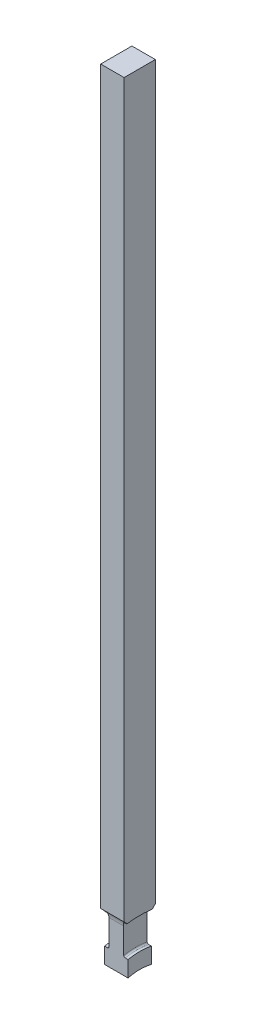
ISO-10303-21;
HEADER;
FILE_DESCRIPTION(('STEP AP214'),'2;1');
FILE_NAME('part.step','',(''),(''),'','','');
FILE_SCHEMA(('AUTOMOTIVE_DESIGN { 1 0 10303 214 1 1 1 1 }'));
ENDSEC;
DATA;
#1=APPLICATION_CONTEXT('core data for automotive mechanical design processes');
#2=APPLICATION_PROTOCOL_DEFINITION('international standard','automotive_design',2000,#1);
#3=PRODUCT_CONTEXT('',#1,'mechanical');
#4=PRODUCT('Part','Part','',(#3));
#5=PRODUCT_RELATED_PRODUCT_CATEGORY('part','',(#4));
#6=PRODUCT_DEFINITION_FORMATION('','',#4);
#7=PRODUCT_DEFINITION_CONTEXT('part definition',#1,'design');
#8=PRODUCT_DEFINITION('design','',#6,#7);
#9=PRODUCT_DEFINITION_SHAPE('','',#8);
#10=(LENGTH_UNIT() NAMED_UNIT(*) SI_UNIT(.MILLI.,.METRE.));
#11=(NAMED_UNIT(*) PLANE_ANGLE_UNIT() SI_UNIT($,.RADIAN.));
#12=(NAMED_UNIT(*) SI_UNIT($,.STERADIAN.) SOLID_ANGLE_UNIT());
#13=UNCERTAINTY_MEASURE_WITH_UNIT(LENGTH_MEASURE(1.E-05),#10,'distance_accuracy_value','');
#14=(GEOMETRIC_REPRESENTATION_CONTEXT(3) GLOBAL_UNCERTAINTY_ASSIGNED_CONTEXT((#13)) GLOBAL_UNIT_ASSIGNED_CONTEXT((#10,
#11,#12)) REPRESENTATION_CONTEXT('',''));
#15=CARTESIAN_POINT('',(0.,0.,0.));
#16=DIRECTION('',(0.,0.,1.));
#17=DIRECTION('',(1.,0.,0.));
#18=AXIS2_PLACEMENT_3D('',#15,#16,#17);
#19=CARTESIAN_POINT('',(3.,212.,4.));
#20=DIRECTION('',(0.,0.,-1.));
#21=DIRECTION('',(0.,1.,0.));
#22=AXIS2_PLACEMENT_3D('',#19,#20,#21);
#23=PLANE('',#22);
#24=DIRECTION('',(0.,-1.,0.));
#25=VECTOR('',#24,1.);
#26=CARTESIAN_POINT('',(-3.,212.,4.));
#27=LINE('',#26,#25);
#28=CARTESIAN_POINT('',(-3.,212.,4.));
#29=VERTEX_POINT('',#28);
#30=CARTESIAN_POINT('',(-3.00000000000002,24.5553873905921,3.99999999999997));
#31=VERTEX_POINT('',#30);
#32=EDGE_CURVE('E236',#29,#31,#27,.T.);
#33=ORIENTED_EDGE('',*,*,#32,.T.);
#34=DIRECTION('',(1.,0.,0.));
#35=VECTOR('',#34,1.);
#36=CARTESIAN_POINT('',(-3.00000000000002,24.5553873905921,3.99999999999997));
#37=LINE('',#36,#35);
#38=CARTESIAN_POINT('',(3.00000000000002,24.5553873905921,3.99999999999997));
#39=VERTEX_POINT('',#38);
#40=EDGE_CURVE('E352',#31,#39,#37,.T.);
#41=ORIENTED_EDGE('',*,*,#40,.T.);
#42=DIRECTION('',(0.,-1.,0.));
#43=VECTOR('',#42,1.);
#44=CARTESIAN_POINT('',(3.,212.,4.));
#45=LINE('',#44,#43);
#46=CARTESIAN_POINT('',(3.,212.,4.));
#47=VERTEX_POINT('',#46);
#48=EDGE_CURVE('E200',#47,#39,#45,.T.);
#49=ORIENTED_EDGE('',*,*,#48,.F.);
#50=DIRECTION('',(-1.,0.,0.));
#51=VECTOR('',#50,1.);
#52=CARTESIAN_POINT('',(3.,212.,4.));
#53=LINE('',#52,#51);
#54=EDGE_CURVE('E191',#47,#29,#53,.T.);
#55=ORIENTED_EDGE('',*,*,#54,.T.);
#56=EDGE_LOOP('',(#33,#41,#49,#55));
#57=FACE_BOUND('',#56,.T.);
#58=ADVANCED_FACE('F37',(#57),#23,.F.);
#59=CARTESIAN_POINT('',(3.,212.,-4.));
#60=DIRECTION('',(0.,0.,1.));
#61=DIRECTION('',(0.,-1.,0.));
#62=AXIS2_PLACEMENT_3D('',#59,#60,#61);
#63=PLANE('',#62);
#64=DIRECTION('',(0.,1.,0.));
#65=VECTOR('',#64,1.);
#66=CARTESIAN_POINT('',(3.,212.,-4.));
#67=LINE('',#66,#65);
#68=CARTESIAN_POINT('',(3.00000000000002,24.5553873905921,-4.00000000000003));
#69=VERTEX_POINT('',#68);
#70=CARTESIAN_POINT('',(3.,212.,-4.));
#71=VERTEX_POINT('',#70);
#72=EDGE_CURVE('E231',#69,#71,#67,.T.);
#73=ORIENTED_EDGE('',*,*,#72,.F.);
#74=DIRECTION('',(1.,0.,0.));
#75=VECTOR('',#74,1.);
#76=CARTESIAN_POINT('',(-3.00000000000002,24.5553873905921,-4.00000000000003));
#77=LINE('',#76,#75);
#78=CARTESIAN_POINT('',(-3.00000000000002,24.5553873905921,-4.00000000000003));
#79=VERTEX_POINT('',#78);
#80=EDGE_CURVE('E387',#69,#79,#77,.F.);
#81=ORIENTED_EDGE('',*,*,#80,.T.);
#82=DIRECTION('',(0.,1.,0.));
#83=VECTOR('',#82,1.);
#84=CARTESIAN_POINT('',(-3.,212.,-4.));
#85=LINE('',#84,#83);
#86=CARTESIAN_POINT('',(-3.,212.,-4.));
#87=VERTEX_POINT('',#86);
#88=EDGE_CURVE('E229',#79,#87,#85,.T.);
#89=ORIENTED_EDGE('',*,*,#88,.T.);
#90=DIRECTION('',(-1.,0.,0.));
#91=VECTOR('',#90,1.);
#92=CARTESIAN_POINT('',(3.,212.,-4.));
#93=LINE('',#92,#91);
#94=EDGE_CURVE('E233',#71,#87,#93,.T.);
#95=ORIENTED_EDGE('',*,*,#94,.F.);
#96=EDGE_LOOP('',(#73,#81,#89,#95));
#97=FACE_BOUND('',#96,.T.);
#98=ADVANCED_FACE('F345',(#97),#63,.F.);
#99=CARTESIAN_POINT('',(3.,0.,0.));
#100=DIRECTION('',(-1.,0.,0.));
#101=DIRECTION('',(0.,0.,1.));
#102=AXIS2_PLACEMENT_3D('',#99,#100,#101);
#103=PLANE('',#102);
#104=CARTESIAN_POINT('',(3.,0.,0.));
#105=DIRECTION('',(1.,0.,0.));
#106=DIRECTION('',(0.,0.,-1.));
#107=AXIS2_PLACEMENT_3D('',#104,#105,#106);
#108=CIRCLE('',#107,12.);
#109=CARTESIAN_POINT('',(3.00000000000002,11.6189500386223,-3.));
#110=VERTEX_POINT('',#109);
#111=CARTESIAN_POINT('',(3.00000000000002,11.6189500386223,3.));
#112=VERTEX_POINT('',#111);
#113=EDGE_CURVE('E210',#110,#112,#108,.T.);
#114=ORIENTED_EDGE('',*,*,#113,.F.);
#115=DIRECTION('',(0.,-1.,0.));
#116=VECTOR('',#115,1.);
#117=CARTESIAN_POINT('',(3.00000000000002,0.,-3.));
#118=LINE('',#117,#116);
#119=CARTESIAN_POINT('',(3.00000000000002,15.7162336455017,-3.));
#120=VERTEX_POINT('',#119);
#121=EDGE_CURVE('E371',#120,#110,#118,.T.);
#122=ORIENTED_EDGE('',*,*,#121,.F.);
#123=CARTESIAN_POINT('',(3.00000000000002,0.,0.));
#124=DIRECTION('',(-1.,0.,0.));
#125=DIRECTION('',(0.,0.,1.));
#126=AXIS2_PLACEMENT_3D('',#123,#124,#125);
#127=CIRCLE('',#126,16.);
#128=CARTESIAN_POINT('',(3.00000000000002,15.7162336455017,3.));
#129=VERTEX_POINT('',#128);
#130=EDGE_CURVE('E206',#129,#120,#127,.T.);
#131=ORIENTED_EDGE('',*,*,#130,.F.);
#132=DIRECTION('',(0.,1.,0.));
#133=VECTOR('',#132,1.);
#134=CARTESIAN_POINT('',(3.00000000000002,0.,3.));
#135=LINE('',#134,#133);
#136=EDGE_CURVE('E201',#112,#129,#135,.T.);
#137=ORIENTED_EDGE('',*,*,#136,.F.);
#138=EDGE_LOOP('',(#114,#122,#131,#137));
#139=FACE_BOUND('',#138,.T.);
#140=ADVANCED_FACE('F339',(#139),#103,.F.);
#141=CARTESIAN_POINT('',(-3.,0.,0.));
#142=DIRECTION('',(-1.,0.,0.));
#143=DIRECTION('',(0.,0.,1.));
#144=AXIS2_PLACEMENT_3D('',#141,#142,#143);
#145=PLANE('',#144);
#146=CARTESIAN_POINT('',(-3.00000000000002,22.6124,-5.3876));
#147=DIRECTION('',(1.,0.,0.));
#148=DIRECTION('',(0.,0.,1.));
#149=AXIS2_PLACEMENT_3D('',#146,#147,#148);
#150=CIRCLE('',#149,2.3876);
#151=CARTESIAN_POINT('',(-3.00000000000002,23.7719741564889,-3.3004915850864));
#152=VERTEX_POINT('',#151);
#153=EDGE_CURVE('E461',#79,#152,#150,.T.);
#154=ORIENTED_EDGE('',*,*,#153,.T.);
#155=CARTESIAN_POINT('',(-3.00000000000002,0.,0.));
#156=DIRECTION('',(-1.,0.,0.));
#157=DIRECTION('',(0.,0.,1.));
#158=AXIS2_PLACEMENT_3D('',#155,#156,#157);
#159=CIRCLE('',#158,24.);
#160=CARTESIAN_POINT('',(-3.00000000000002,23.7719741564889,3.3004915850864));
#161=VERTEX_POINT('',#160);
#162=EDGE_CURVE('E207',#161,#152,#159,.T.);
#163=ORIENTED_EDGE('',*,*,#162,.F.);
#164=CARTESIAN_POINT('',(-3.00000000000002,22.6124,5.3876));
#165=DIRECTION('',(1.,0.,0.));
#166=DIRECTION('',(0.,0.,-1.));
#167=AXIS2_PLACEMENT_3D('',#164,#165,#166);
#168=CIRCLE('',#167,2.3876);
#169=EDGE_CURVE('E359',#161,#31,#168,.T.);
#170=ORIENTED_EDGE('',*,*,#169,.T.);
#171=ORIENTED_EDGE('',*,*,#32,.F.);
#172=DIRECTION('',(0.,0.,1.));
#173=VECTOR('',#172,1.);
#174=CARTESIAN_POINT('',(-3.,212.,4.));
#175=LINE('',#174,#173);
#176=EDGE_CURVE('E226',#87,#29,#175,.T.);
#177=ORIENTED_EDGE('',*,*,#176,.F.);
#178=ORIENTED_EDGE('',*,*,#88,.F.);
#179=EDGE_LOOP('',(#154,#163,#170,#171,#177,#178));
#180=FACE_BOUND('',#179,.T.);
#181=ADVANCED_FACE('F340',(#180),#145,.T.);
#182=DIRECTION('',(0.,-1.,0.));
#183=VECTOR('',#182,1.);
#184=CARTESIAN_POINT('',(-3.00000000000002,0.,-3.));
#185=LINE('',#184,#183);
#186=CARTESIAN_POINT('',(-3.00000000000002,15.7162336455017,-3.));
#187=VERTEX_POINT('',#186);
#188=CARTESIAN_POINT('',(-3.00000000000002,11.6189500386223,-3.));
#189=VERTEX_POINT('',#188);
#190=EDGE_CURVE('E463',#187,#189,#185,.T.);
#191=ORIENTED_EDGE('',*,*,#190,.T.);
#192=CARTESIAN_POINT('',(-3.,0.,0.));
#193=DIRECTION('',(1.,0.,0.));
#194=DIRECTION('',(0.,0.,-1.));
#195=AXIS2_PLACEMENT_3D('',#192,#193,#194);
#196=CIRCLE('',#195,12.);
#197=CARTESIAN_POINT('',(-3.00000000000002,11.6189500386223,3.));
#198=VERTEX_POINT('',#197);
#199=EDGE_CURVE('E223',#189,#198,#196,.T.);
#200=ORIENTED_EDGE('',*,*,#199,.T.);
#201=DIRECTION('',(0.,1.,0.));
#202=VECTOR('',#201,1.);
#203=CARTESIAN_POINT('',(-3.00000000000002,0.,3.));
#204=LINE('',#203,#202);
#205=CARTESIAN_POINT('',(-3.00000000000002,15.7162336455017,3.));
#206=VERTEX_POINT('',#205);
#207=EDGE_CURVE('E362',#198,#206,#204,.T.);
#208=ORIENTED_EDGE('',*,*,#207,.T.);
#209=CARTESIAN_POINT('',(-3.00000000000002,0.,0.));
#210=DIRECTION('',(-1.,0.,0.));
#211=DIRECTION('',(0.,0.,1.));
#212=AXIS2_PLACEMENT_3D('',#209,#210,#211);
#213=CIRCLE('',#212,16.);
#214=EDGE_CURVE('E213',#206,#187,#213,.T.);
#215=ORIENTED_EDGE('',*,*,#214,.T.);
#216=EDGE_LOOP('',(#191,#200,#208,#215));
#217=FACE_BOUND('',#216,.T.);
#218=ADVANCED_FACE('F343',(#217),#145,.T.);
#219=CARTESIAN_POINT('',(3.,212.,4.));
#220=DIRECTION('',(0.,-1.,0.));
#221=DIRECTION('',(0.,0.,-1.));
#222=AXIS2_PLACEMENT_3D('',#219,#220,#221);
#223=PLANE('',#222);
#224=ORIENTED_EDGE('',*,*,#176,.T.);
#225=ORIENTED_EDGE('',*,*,#54,.F.);
#226=DIRECTION('',(0.,0.,1.));
#227=VECTOR('',#226,1.);
#228=CARTESIAN_POINT('',(3.,212.,4.));
#229=LINE('',#228,#227);
#230=EDGE_CURVE('E227',#71,#47,#229,.T.);
#231=ORIENTED_EDGE('',*,*,#230,.F.);
#232=ORIENTED_EDGE('',*,*,#94,.T.);
#233=EDGE_LOOP('',(#224,#225,#231,#232));
#234=FACE_BOUND('',#233,.T.);
#235=ADVANCED_FACE('F283',(#234),#223,.F.);
#236=CARTESIAN_POINT('',(3.00000000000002,0.,0.));
#237=DIRECTION('',(-1.,0.,0.));
#238=DIRECTION('',(0.,0.,1.));
#239=AXIS2_PLACEMENT_3D('',#236,#237,#238);
#240=CIRCLE('',#239,24.);
#241=CARTESIAN_POINT('',(3.00000000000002,23.7719741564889,3.3004915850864));
#242=VERTEX_POINT('',#241);
#243=CARTESIAN_POINT('',(3.00000000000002,23.7719741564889,-3.3004915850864));
#244=VERTEX_POINT('',#243);
#245=EDGE_CURVE('E198',#242,#244,#240,.T.);
#246=ORIENTED_EDGE('',*,*,#245,.T.);
#247=CARTESIAN_POINT('',(3.00000000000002,22.6124,-5.3876));
#248=DIRECTION('',(1.,0.,0.));
#249=DIRECTION('',(0.,0.,1.));
#250=AXIS2_PLACEMENT_3D('',#247,#248,#249);
#251=CIRCLE('',#250,2.3876);
#252=EDGE_CURVE('E467',#69,#244,#251,.T.);
#253=ORIENTED_EDGE('',*,*,#252,.F.);
#254=ORIENTED_EDGE('',*,*,#72,.T.);
#255=ORIENTED_EDGE('',*,*,#230,.T.);
#256=ORIENTED_EDGE('',*,*,#48,.T.);
#257=CARTESIAN_POINT('',(3.00000000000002,22.6124,5.3876));
#258=DIRECTION('',(1.,0.,0.));
#259=DIRECTION('',(0.,0.,-1.));
#260=AXIS2_PLACEMENT_3D('',#257,#258,#259);
#261=CIRCLE('',#260,2.3876);
#262=EDGE_CURVE('E181',#242,#39,#261,.T.);
#263=ORIENTED_EDGE('',*,*,#262,.F.);
#264=EDGE_LOOP('',(#246,#253,#254,#255,#256,#263));
#265=FACE_BOUND('',#264,.T.);
#266=ADVANCED_FACE('F196',(#265),#103,.F.);
#267=CARTESIAN_POINT('',(-3.,0.,0.));
#268=DIRECTION('',(1.,0.,0.));
#269=DIRECTION('',(0.,0.,-1.));
#270=AXIS2_PLACEMENT_3D('',#267,#268,#269);
#271=CYLINDRICAL_SURFACE('',#270,12.);
#272=ORIENTED_EDGE('',*,*,#199,.F.);
#273=DIRECTION('',(1.,0.,0.));
#274=VECTOR('',#273,1.);
#275=CARTESIAN_POINT('',(-3.,11.6189500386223,-3.));
#276=LINE('',#275,#274);
#277=EDGE_CURVE('E216',#189,#110,#276,.T.);
#278=ORIENTED_EDGE('',*,*,#277,.T.);
#279=ORIENTED_EDGE('',*,*,#113,.T.);
#280=DIRECTION('',(1.,0.,0.));
#281=VECTOR('',#280,1.);
#282=CARTESIAN_POINT('',(-3.,11.6189500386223,3.));
#283=LINE('',#282,#281);
#284=EDGE_CURVE('E397',#112,#198,#283,.F.);
#285=ORIENTED_EDGE('',*,*,#284,.T.);
#286=EDGE_LOOP('',(#272,#278,#279,#285));
#287=FACE_BOUND('',#286,.T.);
#288=ADVANCED_FACE('F326',(#287),#271,.F.);
#289=CARTESIAN_POINT('',(-1.905,16.,0.));
#290=DIRECTION('',(-1.,0.,0.));
#291=DIRECTION('',(0.,0.,1.));
#292=AXIS2_PLACEMENT_3D('',#289,#290,#291);
#293=PLANE('',#292);
#294=DIRECTION('',(0.,1.,0.));
#295=VECTOR('',#294,1.);
#296=CARTESIAN_POINT('',(-1.905,16.,-3.));
#297=LINE('',#296,#295);
#298=CARTESIAN_POINT('',(-1.905,16.1039486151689,-3.));
#299=VERTEX_POINT('',#298);
#300=CARTESIAN_POINT('',(-1.905,22.6124,-3.));
#301=VERTEX_POINT('',#300);
#302=EDGE_CURVE('E404',#299,#301,#297,.T.);
#303=ORIENTED_EDGE('',*,*,#302,.F.);
#304=CARTESIAN_POINT('',(-1.905,0.,0.));
#305=DIRECTION('',(-1.,0.,0.));
#306=DIRECTION('',(0.,0.,1.));
#307=AXIS2_PLACEMENT_3D('',#304,#305,#306);
#308=CIRCLE('',#307,16.381);
#309=CARTESIAN_POINT('',(-1.905,16.1039486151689,3.));
#310=VERTEX_POINT('',#309);
#311=EDGE_CURVE('E426',#299,#310,#308,.F.);
#312=ORIENTED_EDGE('',*,*,#311,.T.);
#313=DIRECTION('',(0.,-1.,0.));
#314=VECTOR('',#313,1.);
#315=CARTESIAN_POINT('',(-1.905,16.,3.));
#316=LINE('',#315,#314);
#317=CARTESIAN_POINT('',(-1.905,22.6124,3.));
#318=VERTEX_POINT('',#317);
#319=EDGE_CURVE('E394',#318,#310,#316,.T.);
#320=ORIENTED_EDGE('',*,*,#319,.F.);
#321=CARTESIAN_POINT('',(-1.905,22.6124,5.3876));
#322=DIRECTION('',(-1.,0.,0.));
#323=DIRECTION('',(0.,0.,1.));
#324=AXIS2_PLACEMENT_3D('',#321,#322,#323);
#325=CIRCLE('',#324,2.3876);
#326=CARTESIAN_POINT('',(-1.905,23.0385151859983,3.03833211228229));
#327=VERTEX_POINT('',#326);
#328=EDGE_CURVE('E377',#327,#318,#325,.T.);
#329=ORIENTED_EDGE('',*,*,#328,.F.);
#330=CARTESIAN_POINT('',(-1.905,0.,0.));
#331=DIRECTION('',(-1.,0.,0.));
#332=DIRECTION('',(0.,0.,1.));
#333=AXIS2_PLACEMENT_3D('',#330,#331,#332);
#334=CIRCLE('',#333,23.238);
#335=CARTESIAN_POINT('',(-1.905,23.0385151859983,-3.03833211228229));
#336=VERTEX_POINT('',#335);
#337=EDGE_CURVE('E249',#327,#336,#334,.T.);
#338=ORIENTED_EDGE('',*,*,#337,.T.);
#339=CARTESIAN_POINT('',(-1.905,22.6124,-5.3876));
#340=DIRECTION('',(-1.,0.,0.));
#341=DIRECTION('',(0.,0.,1.));
#342=AXIS2_PLACEMENT_3D('',#339,#340,#341);
#343=CIRCLE('',#342,2.3876);
#344=EDGE_CURVE('E384',#301,#336,#343,.T.);
#345=ORIENTED_EDGE('',*,*,#344,.F.);
#346=EDGE_LOOP('',(#303,#312,#320,#329,#338,#345));
#347=FACE_BOUND('',#346,.T.);
#348=ADVANCED_FACE('F322',(#347),#293,.T.);
#349=CARTESIAN_POINT('',(-8.84822894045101,0.,0.));
#350=DIRECTION('',(-1.,0.,0.));
#351=DIRECTION('',(0.,0.,1.));
#352=AXIS2_PLACEMENT_3D('',#349,#350,#351);
#353=CYLINDRICAL_SURFACE('',#352,24.);
#354=DIRECTION('',(1.,0.,0.));
#355=VECTOR('',#354,1.);
#356=CARTESIAN_POINT('',(-2.45250000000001,23.7719741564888,-3.3004915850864));
#357=LINE('',#356,#355);
#358=CARTESIAN_POINT('',(-2.667,23.7719741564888,-3.3004915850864));
#359=VERTEX_POINT('',#358);
#360=EDGE_CURVE('E382',#359,#152,#357,.F.);
#361=ORIENTED_EDGE('',*,*,#360,.F.);
#362=CARTESIAN_POINT('',(-2.667,0.,0.));
#363=DIRECTION('',(-1.,0.,0.));
#364=DIRECTION('',(0.,0.,1.));
#365=AXIS2_PLACEMENT_3D('',#362,#363,#364);
#366=CIRCLE('',#365,24.);
#367=CARTESIAN_POINT('',(-2.667,23.7719741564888,3.3004915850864));
#368=VERTEX_POINT('',#367);
#369=EDGE_CURVE('E252',#359,#368,#366,.F.);
#370=ORIENTED_EDGE('',*,*,#369,.T.);
#371=DIRECTION('',(1.,0.,0.));
#372=VECTOR('',#371,1.);
#373=CARTESIAN_POINT('',(-2.45250000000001,23.7719741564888,3.3004915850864));
#374=LINE('',#373,#372);
#375=EDGE_CURVE('E374',#161,#368,#374,.T.);
#376=ORIENTED_EDGE('',*,*,#375,.F.);
#377=ORIENTED_EDGE('',*,*,#162,.T.);
#378=EDGE_LOOP('',(#361,#370,#376,#377));
#379=FACE_BOUND('',#378,.T.);
#380=ADVANCED_FACE('F325',(#379),#353,.F.);
#381=CARTESIAN_POINT('',(-8.84822894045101,0.,0.));
#382=DIRECTION('',(-1.,0.,0.));
#383=DIRECTION('',(0.,0.,1.));
#384=AXIS2_PLACEMENT_3D('',#381,#382,#383);
#385=CYLINDRICAL_SURFACE('',#384,16.);
#386=DIRECTION('',(-1.,0.,0.));
#387=VECTOR('',#386,1.);
#388=CARTESIAN_POINT('',(-8.84822894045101,15.7162336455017,3.));
#389=LINE('',#388,#387);
#390=CARTESIAN_POINT('',(-2.286,15.7162336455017,3.));
#391=VERTEX_POINT('',#390);
#392=EDGE_CURVE('E392',#391,#206,#389,.T.);
#393=ORIENTED_EDGE('',*,*,#392,.F.);
#394=CARTESIAN_POINT('',(-2.286,0.,0.));
#395=DIRECTION('',(-1.,0.,0.));
#396=DIRECTION('',(0.,0.,1.));
#397=AXIS2_PLACEMENT_3D('',#394,#395,#396);
#398=CIRCLE('',#397,16.);
#399=CARTESIAN_POINT('',(-2.286,15.7162336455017,-3.));
#400=VERTEX_POINT('',#399);
#401=EDGE_CURVE('E303',#391,#400,#398,.T.);
#402=ORIENTED_EDGE('',*,*,#401,.T.);
#403=DIRECTION('',(-1.,0.,0.));
#404=VECTOR('',#403,1.);
#405=CARTESIAN_POINT('',(-8.84822894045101,15.7162336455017,-3.));
#406=LINE('',#405,#404);
#407=EDGE_CURVE('E402',#187,#400,#406,.F.);
#408=ORIENTED_EDGE('',*,*,#407,.F.);
#409=ORIENTED_EDGE('',*,*,#214,.F.);
#410=EDGE_LOOP('',(#393,#402,#408,#409));
#411=FACE_BOUND('',#410,.T.);
#412=ADVANCED_FACE('F318',(#411),#385,.T.);
#413=CARTESIAN_POINT('',(1.905,16.,0.));
#414=DIRECTION('',(1.,0.,0.));
#415=DIRECTION('',(0.,0.,-1.));
#416=AXIS2_PLACEMENT_3D('',#413,#414,#415);
#417=PLANE('',#416);
#418=DIRECTION('',(0.,1.,0.));
#419=VECTOR('',#418,1.);
#420=CARTESIAN_POINT('',(1.905,16.,3.));
#421=LINE('',#420,#419);
#422=CARTESIAN_POINT('',(1.905,16.1039486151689,3.));
#423=VERTEX_POINT('',#422);
#424=CARTESIAN_POINT('',(1.905,22.6124,3.));
#425=VERTEX_POINT('',#424);
#426=EDGE_CURVE('E390',#423,#425,#421,.T.);
#427=ORIENTED_EDGE('',*,*,#426,.F.);
#428=CARTESIAN_POINT('',(1.905,0.,0.));
#429=DIRECTION('',(1.,0.,0.));
#430=DIRECTION('',(0.,0.,-1.));
#431=AXIS2_PLACEMENT_3D('',#428,#429,#430);
#432=CIRCLE('',#431,16.381);
#433=CARTESIAN_POINT('',(1.905,16.1039486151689,-3.));
#434=VERTEX_POINT('',#433);
#435=EDGE_CURVE('E422',#423,#434,#432,.F.);
#436=ORIENTED_EDGE('',*,*,#435,.T.);
#437=DIRECTION('',(0.,-1.,0.));
#438=VECTOR('',#437,1.);
#439=CARTESIAN_POINT('',(1.905,16.,-3.));
#440=LINE('',#439,#438);
#441=CARTESIAN_POINT('',(1.905,22.6124,-3.));
#442=VERTEX_POINT('',#441);
#443=EDGE_CURVE('E400',#442,#434,#440,.T.);
#444=ORIENTED_EDGE('',*,*,#443,.F.);
#445=CARTESIAN_POINT('',(1.905,22.6124,-5.3876));
#446=DIRECTION('',(1.,0.,0.));
#447=DIRECTION('',(0.,0.,-1.));
#448=AXIS2_PLACEMENT_3D('',#445,#446,#447);
#449=CIRCLE('',#448,2.3876);
#450=CARTESIAN_POINT('',(1.905,23.0385151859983,-3.03833211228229));
#451=VERTEX_POINT('',#450);
#452=EDGE_CURVE('E380',#451,#442,#449,.T.);
#453=ORIENTED_EDGE('',*,*,#452,.F.);
#454=CARTESIAN_POINT('',(1.905,0.,0.));
#455=DIRECTION('',(1.,0.,0.));
#456=DIRECTION('',(0.,0.,-1.));
#457=AXIS2_PLACEMENT_3D('',#454,#455,#456);
#458=CIRCLE('',#457,23.238);
#459=CARTESIAN_POINT('',(1.905,23.0385151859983,3.03833211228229));
#460=VERTEX_POINT('',#459);
#461=EDGE_CURVE('E256',#451,#460,#458,.T.);
#462=ORIENTED_EDGE('',*,*,#461,.T.);
#463=CARTESIAN_POINT('',(1.905,22.6124,5.3876));
#464=DIRECTION('',(1.,0.,0.));
#465=DIRECTION('',(0.,0.,-1.));
#466=AXIS2_PLACEMENT_3D('',#463,#464,#465);
#467=CIRCLE('',#466,2.3876);
#468=EDGE_CURVE('E372',#425,#460,#467,.T.);
#469=ORIENTED_EDGE('',*,*,#468,.F.);
#470=EDGE_LOOP('',(#427,#436,#444,#453,#462,#469));
#471=FACE_BOUND('',#470,.T.);
#472=ADVANCED_FACE('F315',(#471),#417,.T.);
#473=CARTESIAN_POINT('',(-8.84822894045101,0.,0.));
#474=DIRECTION('',(-1.,0.,0.));
#475=DIRECTION('',(0.,0.,1.));
#476=AXIS2_PLACEMENT_3D('',#473,#474,#475);
#477=CYLINDRICAL_SURFACE('',#476,16.);
#478=DIRECTION('',(-1.,0.,0.));
#479=VECTOR('',#478,1.);
#480=CARTESIAN_POINT('',(-8.84822894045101,15.7162336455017,-3.));
#481=LINE('',#480,#479);
#482=CARTESIAN_POINT('',(2.286,15.7162336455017,-3.));
#483=VERTEX_POINT('',#482);
#484=EDGE_CURVE('E247',#483,#120,#481,.F.);
#485=ORIENTED_EDGE('',*,*,#484,.F.);
#486=CARTESIAN_POINT('',(2.286,0.,0.));
#487=DIRECTION('',(1.,0.,0.));
#488=DIRECTION('',(0.,0.,-1.));
#489=AXIS2_PLACEMENT_3D('',#486,#487,#488);
#490=CIRCLE('',#489,16.);
#491=CARTESIAN_POINT('',(2.286,15.7162336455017,3.));
#492=VERTEX_POINT('',#491);
#493=EDGE_CURVE('E58',#483,#492,#490,.T.);
#494=ORIENTED_EDGE('',*,*,#493,.T.);
#495=DIRECTION('',(-1.,0.,0.));
#496=VECTOR('',#495,1.);
#497=CARTESIAN_POINT('',(-8.84822894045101,15.7162336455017,3.));
#498=LINE('',#497,#496);
#499=EDGE_CURVE('E245',#129,#492,#498,.T.);
#500=ORIENTED_EDGE('',*,*,#499,.F.);
#501=ORIENTED_EDGE('',*,*,#130,.T.);
#502=EDGE_LOOP('',(#485,#494,#500,#501));
#503=FACE_BOUND('',#502,.T.);
#504=ADVANCED_FACE('F314',(#503),#477,.T.);
#505=CARTESIAN_POINT('',(-8.84822894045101,0.,0.));
#506=DIRECTION('',(-1.,0.,0.));
#507=DIRECTION('',(0.,0.,1.));
#508=AXIS2_PLACEMENT_3D('',#505,#506,#507);
#509=CYLINDRICAL_SURFACE('',#508,24.);
#510=DIRECTION('',(1.,0.,0.));
#511=VECTOR('',#510,1.);
#512=CARTESIAN_POINT('',(2.45250000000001,23.7719741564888,3.3004915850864));
#513=LINE('',#512,#511);
#514=CARTESIAN_POINT('',(2.667,23.7719741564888,3.3004915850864));
#515=VERTEX_POINT('',#514);
#516=EDGE_CURVE('E178',#515,#242,#513,.T.);
#517=ORIENTED_EDGE('',*,*,#516,.F.);
#518=CARTESIAN_POINT('',(2.667,0.,0.));
#519=DIRECTION('',(1.,0.,0.));
#520=DIRECTION('',(0.,0.,-1.));
#521=AXIS2_PLACEMENT_3D('',#518,#519,#520);
#522=CIRCLE('',#521,24.);
#523=CARTESIAN_POINT('',(2.667,23.7719741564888,-3.3004915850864));
#524=VERTEX_POINT('',#523);
#525=EDGE_CURVE('E254',#515,#524,#522,.F.);
#526=ORIENTED_EDGE('',*,*,#525,.T.);
#527=DIRECTION('',(1.,0.,0.));
#528=VECTOR('',#527,1.);
#529=CARTESIAN_POINT('',(2.45250000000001,23.7719741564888,-3.3004915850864));
#530=LINE('',#529,#528);
#531=EDGE_CURVE('E190',#244,#524,#530,.F.);
#532=ORIENTED_EDGE('',*,*,#531,.F.);
#533=ORIENTED_EDGE('',*,*,#245,.F.);
#534=EDGE_LOOP('',(#517,#526,#532,#533));
#535=FACE_BOUND('',#534,.T.);
#536=ADVANCED_FACE('F204',(#535),#509,.F.);
#537=CARTESIAN_POINT('',(-3.00000000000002,0.,3.));
#538=DIRECTION('',(0.,0.,-1.));
#539=DIRECTION('',(0.,1.,0.));
#540=AXIS2_PLACEMENT_3D('',#537,#538,#539);
#541=PLANE('',#540);
#542=ORIENTED_EDGE('',*,*,#136,.T.);
#543=ORIENTED_EDGE('',*,*,#499,.T.);
#544=CARTESIAN_POINT('',(2.286,15.7162336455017,3.));
#545=CARTESIAN_POINT('',(2.26483852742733,15.7162138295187,3.));
#546=CARTESIAN_POINT('',(2.24368479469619,15.7180272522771,3.));
#547=CARTESIAN_POINT('',(2.20200688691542,15.7251715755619,3.));
#548=CARTESIAN_POINT('',(2.18148193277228,15.7304979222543,3.));
#549=CARTESIAN_POINT('',(2.14161183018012,15.7445219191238,3.));
#550=CARTESIAN_POINT('',(2.12226704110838,15.7532205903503,3.));
#551=CARTESIAN_POINT('',(2.08529777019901,15.7737154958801,3.));
#552=CARTESIAN_POINT('',(2.06767323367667,15.7855116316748,3.));
#553=CARTESIAN_POINT('',(2.03448598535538,15.8119557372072,3.));
#554=CARTESIAN_POINT('',(2.01894051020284,15.8266253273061,3.));
#555=CARTESIAN_POINT('',(1.99048101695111,15.8583304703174,3.));
#556=CARTESIAN_POINT('',(1.97756759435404,15.875366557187,3.));
#557=CARTESIAN_POINT('',(1.95451065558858,15.9116241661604,3.));
#558=CARTESIAN_POINT('',(1.94441753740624,15.9308777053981,3.));
#559=CARTESIAN_POINT('',(1.92755440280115,15.9707855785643,3.));
#560=CARTESIAN_POINT('',(1.92078322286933,15.9914394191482,3.));
#561=CARTESIAN_POINT('',(1.91218275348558,16.0274736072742,3.));
#562=CARTESIAN_POINT('',(1.90949097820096,16.0426541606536,3.));
#563=CARTESIAN_POINT('',(1.90589964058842,16.0732042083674,3.));
#564=CARTESIAN_POINT('',(1.90499757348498,16.088573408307,3.));
#565=CARTESIAN_POINT('',(1.905,16.1039486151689,3.));
#566=B_SPLINE_CURVE_WITH_KNOTS('',3,(#544,#545,#546,#547,#548,#549,#550,#551,#552,#553,#554,
#555,#556,#557,#558,#559,#560,#561,#562,#563,#564,#565),.UNSPECIFIED.,.F.,.F.,(4,2,2,2,2,2,2,2,
2,2,4),(0.,0.0633953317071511,0.126708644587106,0.190041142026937,0.253371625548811,
0.317198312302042,0.381039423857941,0.445957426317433,0.510852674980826,0.557004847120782,
0.603092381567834),.UNSPECIFIED.);
#567=EDGE_CURVE('E11',#492,#423,#566,.T.);
#568=ORIENTED_EDGE('',*,*,#567,.T.);
#569=ORIENTED_EDGE('',*,*,#426,.T.);
#570=DIRECTION('',(1.,0.,0.));
#571=VECTOR('',#570,1.);
#572=CARTESIAN_POINT('',(-3.00000000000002,22.6124,3.));
#573=LINE('',#572,#571);
#574=EDGE_CURVE('E365',#318,#425,#573,.T.);
#575=ORIENTED_EDGE('',*,*,#574,.F.);
#576=ORIENTED_EDGE('',*,*,#319,.T.);
#577=CARTESIAN_POINT('',(-1.905,16.1039486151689,3.));
#578=CARTESIAN_POINT('',(-1.90498313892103,16.0818581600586,3.));
#579=CARTESIAN_POINT('',(-1.90685583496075,16.0597712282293,3.));
#580=CARTESIAN_POINT('',(-1.91425675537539,16.0162247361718,3.));
#581=CARTESIAN_POINT('',(-1.91978390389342,15.9947649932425,3.));
#582=CARTESIAN_POINT('',(-1.93437489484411,15.9530662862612,3.));
#583=CARTESIAN_POINT('',(-1.94344097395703,15.9328281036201,3.));
#584=CARTESIAN_POINT('',(-1.96486395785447,15.8941821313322,3.));
#585=CARTESIAN_POINT('',(-1.9772198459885,15.8757737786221,3.));
#586=CARTESIAN_POINT('',(-2.00478592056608,15.8414646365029,3.));
#587=CARTESIAN_POINT('',(-2.01997366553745,15.8255458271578,3.));
#588=CARTESIAN_POINT('',(-2.05285036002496,15.7965326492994,3.));
#589=CARTESIAN_POINT('',(-2.07053969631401,15.7834387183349,3.));
#590=CARTESIAN_POINT('',(-2.10760244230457,15.7606829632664,3.));
#591=CARTESIAN_POINT('',(-2.12694358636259,15.7509685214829,3.));
#592=CARTESIAN_POINT('',(-2.16699486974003,15.734991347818,3.));
#593=CARTESIAN_POINT('',(-2.18770383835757,15.7287257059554,3.));
#594=CARTESIAN_POINT('',(-2.22147725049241,15.7216077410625,3.));
#595=CARTESIAN_POINT('',(-2.23430798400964,15.7195936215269,3.));
#596=CARTESIAN_POINT('',(-2.26009046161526,15.7169069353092,3.));
#597=CARTESIAN_POINT('',(-2.27304200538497,15.7162324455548,3.));
#598=CARTESIAN_POINT('',(-2.28599999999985,15.716233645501,3.));
#599=B_SPLINE_CURVE_WITH_KNOTS('',3,(#577,#578,#579,#580,#581,#582,#583,#584,#585,#586,#587,
#588,#589,#590,#591,#592,#593,#594,#595,#596,#597,#598),.UNSPECIFIED.,.F.,.F.,(4,2,2,2,2,2,2,2,
2,2,4),(0.,0.0661875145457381,0.132355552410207,0.198565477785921,0.264754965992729,
0.330440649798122,0.396136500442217,0.460758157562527,0.525325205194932,0.564224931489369,
0.603068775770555),.UNSPECIFIED.);
#600=EDGE_CURVE('E424',#310,#391,#599,.T.);
#601=ORIENTED_EDGE('',*,*,#600,.T.);
#602=ORIENTED_EDGE('',*,*,#392,.T.);
#603=ORIENTED_EDGE('',*,*,#207,.F.);
#604=ORIENTED_EDGE('',*,*,#284,.F.);
#605=EDGE_LOOP('',(#542,#543,#568,#569,#575,#576,#601,#602,#603,#604));
#606=FACE_BOUND('',#605,.T.);
#607=ADVANCED_FACE('F309',(#606),#541,.F.);
#608=CARTESIAN_POINT('',(-3.00000000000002,22.6124,5.3876));
#609=DIRECTION('',(1.,0.,0.));
#610=DIRECTION('',(0.,0.,-1.));
#611=AXIS2_PLACEMENT_3D('',#608,#609,#610);
#612=CYLINDRICAL_SURFACE('',#611,2.3876);
#613=ORIENTED_EDGE('',*,*,#169,.F.);
#614=ORIENTED_EDGE('',*,*,#375,.T.);
#615=CARTESIAN_POINT('',(-2.667,23.7719741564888,3.3004915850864));
#616=CARTESIAN_POINT('',(-2.62570561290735,23.7720095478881,3.30054623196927));
#617=CARTESIAN_POINT('',(-2.58445319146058,23.7688309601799,3.29874524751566));
#618=CARTESIAN_POINT('',(-2.50330653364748,23.7563407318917,3.29186100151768));
#619=CARTESIAN_POINT('',(-2.46340816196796,23.7470499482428,3.28678890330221));
#620=CARTESIAN_POINT('',(-2.38597312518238,23.7226345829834,3.27379029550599));
#621=CARTESIAN_POINT('',(-2.34843495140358,23.7075137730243,3.26586563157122));
#622=CARTESIAN_POINT('',(-2.27656689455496,23.6718664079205,3.24784175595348));
#623=CARTESIAN_POINT('',(-2.24223932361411,23.651335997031,3.23774099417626));
#624=CARTESIAN_POINT('',(-2.17626612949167,23.6044267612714,3.21568550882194));
#625=CARTESIAN_POINT('',(-2.14478322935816,23.5778464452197,3.20367268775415));
#626=CARTESIAN_POINT('',(-2.08683665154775,23.5199347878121,3.17897949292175));
#627=CARTESIAN_POINT('',(-2.06037440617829,23.4886020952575,3.16629892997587));
#628=CARTESIAN_POINT('',(-2.01221432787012,23.4205459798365,3.14062306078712));
#629=CARTESIAN_POINT('',(-1.99074076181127,23.3836607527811,3.12763459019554));
#630=CARTESIAN_POINT('',(-1.95461834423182,23.306376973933,3.10272069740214));
#631=CARTESIAN_POINT('',(-1.93996308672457,23.2659817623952,3.09079428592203));
#632=CARTESIAN_POINT('',(-1.92106478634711,23.194342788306,3.07179723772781));
#633=CARTESIAN_POINT('',(-1.91506150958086,23.1636666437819,3.064297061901));
#634=CARTESIAN_POINT('',(-1.90702361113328,23.1015463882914,3.05042273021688));
#635=CARTESIAN_POINT('',(-1.90498954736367,23.0701021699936,3.04404873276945));
#636=CARTESIAN_POINT('',(-1.905,23.0385151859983,3.03833211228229));
#637=B_SPLINE_CURVE_WITH_KNOTS('',3,(#615,#616,#617,#618,#619,#620,#621,#622,#623,#624,#625,
#626,#627,#628,#629,#630,#631,#632,#633,#634,#635,#636),.UNSPECIFIED.,.F.,.F.,(4,2,2,2,2,2,2,2,
2,2,4),(0.,0.123656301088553,0.246892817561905,0.370049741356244,0.493294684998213,
0.621481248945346,0.749704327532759,0.882894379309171,1.01595904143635,1.11213377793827,
1.20832203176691),.UNSPECIFIED.);
#638=EDGE_CURVE('E266',#368,#327,#637,.T.);
#639=ORIENTED_EDGE('',*,*,#638,.T.);
#640=ORIENTED_EDGE('',*,*,#328,.T.);
#641=ORIENTED_EDGE('',*,*,#574,.T.);
#642=ORIENTED_EDGE('',*,*,#468,.T.);
#643=CARTESIAN_POINT('',(1.905,23.0385151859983,3.03833211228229));
#644=CARTESIAN_POINT('',(1.90496142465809,23.0800496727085,3.04582495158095));
#645=CARTESIAN_POINT('',(1.90849535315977,23.1213303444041,3.054489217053));
#646=CARTESIAN_POINT('',(1.92233286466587,23.2021835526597,3.07362964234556));
#647=CARTESIAN_POINT('',(1.93261685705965,23.2417606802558,3.08410049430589));
#648=CARTESIAN_POINT('',(1.95957545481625,23.3182371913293,3.10636596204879));
#649=CARTESIAN_POINT('',(1.97624644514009,23.3551380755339,3.11815982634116));
#650=CARTESIAN_POINT('',(2.01545075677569,23.4254662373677,3.14239644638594));
#651=CARTESIAN_POINT('',(2.03798759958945,23.4588914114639,3.15483958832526));
#652=CARTESIAN_POINT('',(2.08919258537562,23.5226220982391,3.18003450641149));
#653=CARTESIAN_POINT('',(2.11804373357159,23.5527822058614,3.19278232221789));
#654=CARTESIAN_POINT('',(2.18068244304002,23.607972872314,3.21725869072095));
#655=CARTESIAN_POINT('',(2.21447129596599,23.633002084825,3.22898697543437));
#656=CARTESIAN_POINT('',(2.28692923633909,23.6777883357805,3.25072942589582));
#657=CARTESIAN_POINT('',(2.32568491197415,23.6974254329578,3.26070305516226));
#658=CARTESIAN_POINT('',(2.40645623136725,23.7301228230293,3.27770155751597));
#659=CARTESIAN_POINT('',(2.44846773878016,23.7431913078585,3.28473010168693));
#660=CARTESIAN_POINT('',(2.52011875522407,23.7591190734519,3.29338831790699));
#661=CARTESIAN_POINT('',(2.54921721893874,23.7639290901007,3.29603653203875));
#662=CARTESIAN_POINT('',(2.60787020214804,23.7703600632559,3.29959472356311));
#663=CARTESIAN_POINT('',(2.63742475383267,23.7719807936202,3.30050457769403));
#664=CARTESIAN_POINT('',(2.667,23.7719741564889,3.3004915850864));
#665=B_SPLINE_CURVE_WITH_KNOTS('',3,(#643,#644,#645,#646,#647,#648,#649,#650,#651,#652,#653,
#654,#655,#656,#657,#658,#659,#660,#661,#662,#663,#664),.UNSPECIFIED.,.F.,.F.,(4,2,2,2,2,2,2,2,
2,2,4),(0.,0.126389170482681,0.252413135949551,0.378365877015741,0.504394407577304,
0.634724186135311,0.765088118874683,0.898152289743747,1.03105009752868,1.11967330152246,
1.20830278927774),.UNSPECIFIED.);
#666=EDGE_CURVE('E185',#460,#515,#665,.T.);
#667=ORIENTED_EDGE('',*,*,#666,.T.);
#668=ORIENTED_EDGE('',*,*,#516,.T.);
#669=ORIENTED_EDGE('',*,*,#262,.T.);
#670=ORIENTED_EDGE('',*,*,#40,.F.);
#671=EDGE_LOOP('',(#613,#614,#639,#640,#641,#642,#667,#668,#669,#670));
#672=FACE_BOUND('',#671,.T.);
#673=ADVANCED_FACE('F180',(#672),#612,.F.);
#674=CARTESIAN_POINT('',(-3.00000000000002,0.,-3.));
#675=DIRECTION('',(0.,0.,1.));
#676=DIRECTION('',(1.,0.,0.));
#677=AXIS2_PLACEMENT_3D('',#674,#675,#676);
#678=PLANE('',#677);
#679=ORIENTED_EDGE('',*,*,#190,.F.);
#680=ORIENTED_EDGE('',*,*,#407,.T.);
#681=CARTESIAN_POINT('',(-2.286,15.7162336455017,-3.));
#682=CARTESIAN_POINT('',(-2.26483852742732,15.7162138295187,-3.));
#683=CARTESIAN_POINT('',(-2.24368479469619,15.7180272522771,-3.));
#684=CARTESIAN_POINT('',(-2.20200688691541,15.7251715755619,-3.));
#685=CARTESIAN_POINT('',(-2.18148193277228,15.7304979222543,-3.));
#686=CARTESIAN_POINT('',(-2.14161183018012,15.7445219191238,-3.));
#687=CARTESIAN_POINT('',(-2.12226704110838,15.7532205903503,-3.));
#688=CARTESIAN_POINT('',(-2.08529777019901,15.7737154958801,-3.));
#689=CARTESIAN_POINT('',(-2.06767323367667,15.7855116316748,-3.));
#690=CARTESIAN_POINT('',(-2.03448598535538,15.8119557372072,-3.));
#691=CARTESIAN_POINT('',(-2.01894051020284,15.8266253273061,-3.));
#692=CARTESIAN_POINT('',(-1.99048101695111,15.8583304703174,-3.));
#693=CARTESIAN_POINT('',(-1.97756759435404,15.875366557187,-3.));
#694=CARTESIAN_POINT('',(-1.95451065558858,15.9116241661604,-3.));
#695=CARTESIAN_POINT('',(-1.94441753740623,15.9308777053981,-3.));
#696=CARTESIAN_POINT('',(-1.92755440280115,15.9707855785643,-3.));
#697=CARTESIAN_POINT('',(-1.92078322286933,15.9914394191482,-3.));
#698=CARTESIAN_POINT('',(-1.91218275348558,16.0274736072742,-3.));
#699=CARTESIAN_POINT('',(-1.90949097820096,16.0426541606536,-3.));
#700=CARTESIAN_POINT('',(-1.90589964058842,16.0732042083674,-3.));
#701=CARTESIAN_POINT('',(-1.90499757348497,16.088573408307,-3.));
#702=CARTESIAN_POINT('',(-1.905,16.1039486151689,-3.));
#703=B_SPLINE_CURVE_WITH_KNOTS('',3,(#681,#682,#683,#684,#685,#686,#687,#688,#689,#690,#691,
#692,#693,#694,#695,#696,#697,#698,#699,#700,#701,#702),.UNSPECIFIED.,.F.,.F.,(4,2,2,2,2,2,2,2,
2,2,4),(0.,0.0633953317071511,0.126708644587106,0.190041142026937,0.253371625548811,
0.317198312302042,0.381039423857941,0.445957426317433,0.510852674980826,0.557004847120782,
0.603092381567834),.UNSPECIFIED.);
#704=EDGE_CURVE('E421',#400,#299,#703,.T.);
#705=ORIENTED_EDGE('',*,*,#704,.T.);
#706=ORIENTED_EDGE('',*,*,#302,.T.);
#707=DIRECTION('',(1.,0.,0.));
#708=VECTOR('',#707,1.);
#709=CARTESIAN_POINT('',(-3.00000000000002,22.6124,-3.));
#710=LINE('',#709,#708);
#711=EDGE_CURVE('E375',#301,#442,#710,.T.);
#712=ORIENTED_EDGE('',*,*,#711,.T.);
#713=ORIENTED_EDGE('',*,*,#443,.T.);
#714=CARTESIAN_POINT('',(1.905,16.1039486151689,-3.));
#715=CARTESIAN_POINT('',(1.90498313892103,16.0818581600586,-3.));
#716=CARTESIAN_POINT('',(1.90685583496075,16.0597712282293,-3.));
#717=CARTESIAN_POINT('',(1.91425675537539,16.0162247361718,-3.));
#718=CARTESIAN_POINT('',(1.91978390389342,15.9947649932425,-3.));
#719=CARTESIAN_POINT('',(1.93437489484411,15.9530662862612,-3.));
#720=CARTESIAN_POINT('',(1.94344097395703,15.9328281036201,-3.));
#721=CARTESIAN_POINT('',(1.96486395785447,15.8941821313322,-3.));
#722=CARTESIAN_POINT('',(1.97721984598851,15.8757737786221,-3.));
#723=CARTESIAN_POINT('',(2.00478592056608,15.8414646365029,-3.));
#724=CARTESIAN_POINT('',(2.01997366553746,15.8255458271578,-3.));
#725=CARTESIAN_POINT('',(2.05285036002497,15.7965326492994,-3.));
#726=CARTESIAN_POINT('',(2.07053969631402,15.7834387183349,-3.));
#727=CARTESIAN_POINT('',(2.10760244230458,15.7606829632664,-3.));
#728=CARTESIAN_POINT('',(2.12694358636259,15.7509685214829,-3.));
#729=CARTESIAN_POINT('',(2.16699486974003,15.734991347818,-3.));
#730=CARTESIAN_POINT('',(2.18770383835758,15.7287257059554,-3.));
#731=CARTESIAN_POINT('',(2.22147725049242,15.7216077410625,-3.));
#732=CARTESIAN_POINT('',(2.23430798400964,15.7195936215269,-3.));
#733=CARTESIAN_POINT('',(2.26009046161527,15.7169069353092,-3.));
#734=CARTESIAN_POINT('',(2.27304200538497,15.7162324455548,-3.));
#735=CARTESIAN_POINT('',(2.28599999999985,15.716233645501,-3.));
#736=B_SPLINE_CURVE_WITH_KNOTS('',3,(#714,#715,#716,#717,#718,#719,#720,#721,#722,#723,#724,
#725,#726,#727,#728,#729,#730,#731,#732,#733,#734,#735),.UNSPECIFIED.,.F.,.F.,(4,2,2,2,2,2,2,2,
2,2,4),(0.,0.0661875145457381,0.132355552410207,0.198565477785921,0.264754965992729,
0.330440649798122,0.396136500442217,0.460758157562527,0.525325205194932,0.564224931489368,
0.603068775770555),.UNSPECIFIED.);
#737=EDGE_CURVE('E51',#434,#483,#736,.T.);
#738=ORIENTED_EDGE('',*,*,#737,.T.);
#739=ORIENTED_EDGE('',*,*,#484,.T.);
#740=ORIENTED_EDGE('',*,*,#121,.T.);
#741=ORIENTED_EDGE('',*,*,#277,.F.);
#742=EDGE_LOOP('',(#679,#680,#705,#706,#712,#713,#738,#739,#740,#741));
#743=FACE_BOUND('',#742,.T.);
#744=ADVANCED_FACE('F308',(#743),#678,.F.);
#745=CARTESIAN_POINT('',(-3.00000000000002,22.6124,-5.3876));
#746=DIRECTION('',(1.,0.,0.));
#747=DIRECTION('',(0.,0.,-1.));
#748=AXIS2_PLACEMENT_3D('',#745,#746,#747);
#749=CYLINDRICAL_SURFACE('',#748,2.3876);
#750=ORIENTED_EDGE('',*,*,#252,.T.);
#751=ORIENTED_EDGE('',*,*,#531,.T.);
#752=CARTESIAN_POINT('',(2.667,23.7719741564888,-3.3004915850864));
#753=CARTESIAN_POINT('',(2.62570561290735,23.7720095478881,-3.30054623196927));
#754=CARTESIAN_POINT('',(2.58445319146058,23.7688309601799,-3.29874524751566));
#755=CARTESIAN_POINT('',(2.50330653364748,23.7563407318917,-3.29186100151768));
#756=CARTESIAN_POINT('',(2.46340816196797,23.7470499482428,-3.28678890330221));
#757=CARTESIAN_POINT('',(2.38597312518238,23.7226345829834,-3.27379029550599));
#758=CARTESIAN_POINT('',(2.34843495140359,23.7075137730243,-3.26586563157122));
#759=CARTESIAN_POINT('',(2.27656689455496,23.6718664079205,-3.24784175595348));
#760=CARTESIAN_POINT('',(2.24223932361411,23.651335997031,-3.23774099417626));
#761=CARTESIAN_POINT('',(2.17626612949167,23.6044267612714,-3.21568550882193));
#762=CARTESIAN_POINT('',(2.14478322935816,23.5778464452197,-3.20367268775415));
#763=CARTESIAN_POINT('',(2.08683665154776,23.5199347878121,-3.17897949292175));
#764=CARTESIAN_POINT('',(2.06037440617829,23.4886020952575,-3.16629892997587));
#765=CARTESIAN_POINT('',(2.01221432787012,23.4205459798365,-3.14062306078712));
#766=CARTESIAN_POINT('',(1.99074076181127,23.3836607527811,-3.12763459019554));
#767=CARTESIAN_POINT('',(1.95461834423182,23.306376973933,-3.10272069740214));
#768=CARTESIAN_POINT('',(1.93996308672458,23.2659817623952,-3.09079428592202));
#769=CARTESIAN_POINT('',(1.92106478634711,23.194342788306,-3.07179723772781));
#770=CARTESIAN_POINT('',(1.91506150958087,23.1636666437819,-3.064297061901));
#771=CARTESIAN_POINT('',(1.90702361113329,23.1015463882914,-3.05042273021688));
#772=CARTESIAN_POINT('',(1.90498954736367,23.0701021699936,-3.04404873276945));
#773=CARTESIAN_POINT('',(1.905,23.0385151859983,-3.03833211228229));
#774=B_SPLINE_CURVE_WITH_KNOTS('',3,(#752,#753,#754,#755,#756,#757,#758,#759,#760,#761,#762,
#763,#764,#765,#766,#767,#768,#769,#770,#771,#772,#773),.UNSPECIFIED.,.F.,.F.,(4,2,2,2,2,2,2,2,
2,2,4),(0.,0.123656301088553,0.246892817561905,0.370049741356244,0.493294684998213,
0.621481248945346,0.749704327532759,0.882894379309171,1.01595904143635,1.11213377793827,
1.20832203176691),.UNSPECIFIED.);
#775=EDGE_CURVE('E292',#524,#451,#774,.T.);
#776=ORIENTED_EDGE('',*,*,#775,.T.);
#777=ORIENTED_EDGE('',*,*,#452,.T.);
#778=ORIENTED_EDGE('',*,*,#711,.F.);
#779=ORIENTED_EDGE('',*,*,#344,.T.);
#780=CARTESIAN_POINT('',(-1.905,23.0385151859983,-3.03833211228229));
#781=CARTESIAN_POINT('',(-1.90496142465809,23.0800496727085,-3.04582495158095));
#782=CARTESIAN_POINT('',(-1.90849535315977,23.1213303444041,-3.054489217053));
#783=CARTESIAN_POINT('',(-1.92233286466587,23.2021835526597,-3.07362964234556));
#784=CARTESIAN_POINT('',(-1.93261685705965,23.2417606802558,-3.08410049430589));
#785=CARTESIAN_POINT('',(-1.95957545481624,23.3182371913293,-3.10636596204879));
#786=CARTESIAN_POINT('',(-1.97624644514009,23.3551380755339,-3.11815982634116));
#787=CARTESIAN_POINT('',(-2.01545075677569,23.4254662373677,-3.14239644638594));
#788=CARTESIAN_POINT('',(-2.03798759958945,23.4588914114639,-3.15483958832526));
#789=CARTESIAN_POINT('',(-2.08919258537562,23.5226220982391,-3.18003450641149));
#790=CARTESIAN_POINT('',(-2.11804373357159,23.5527822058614,-3.19278232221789));
#791=CARTESIAN_POINT('',(-2.18068244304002,23.607972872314,-3.21725869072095));
#792=CARTESIAN_POINT('',(-2.21447129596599,23.633002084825,-3.22898697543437));
#793=CARTESIAN_POINT('',(-2.28692923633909,23.6777883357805,-3.25072942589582));
#794=CARTESIAN_POINT('',(-2.32568491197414,23.6974254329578,-3.26070305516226));
#795=CARTESIAN_POINT('',(-2.40645623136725,23.7301228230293,-3.27770155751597));
#796=CARTESIAN_POINT('',(-2.44846773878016,23.7431913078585,-3.28473010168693));
#797=CARTESIAN_POINT('',(-2.52011875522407,23.7591190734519,-3.29338831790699));
#798=CARTESIAN_POINT('',(-2.54921721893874,23.7639290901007,-3.29603653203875));
#799=CARTESIAN_POINT('',(-2.60787020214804,23.7703600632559,-3.29959472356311));
#800=CARTESIAN_POINT('',(-2.63742475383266,23.7719807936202,-3.30050457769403));
#801=CARTESIAN_POINT('',(-2.667,23.7719741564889,-3.3004915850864));
#802=B_SPLINE_CURVE_WITH_KNOTS('',3,(#780,#781,#782,#783,#784,#785,#786,#787,#788,#789,#790,
#791,#792,#793,#794,#795,#796,#797,#798,#799,#800,#801),.UNSPECIFIED.,.F.,.F.,(4,2,2,2,2,2,2,2,
2,2,4),(0.,0.126389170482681,0.252413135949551,0.378365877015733,0.504394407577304,
0.634724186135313,0.765088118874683,0.898152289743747,1.03105009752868,1.11967330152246,
1.20830278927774),.UNSPECIFIED.);
#803=EDGE_CURVE('E258',#336,#359,#802,.T.);
#804=ORIENTED_EDGE('',*,*,#803,.T.);
#805=ORIENTED_EDGE('',*,*,#360,.T.);
#806=ORIENTED_EDGE('',*,*,#153,.F.);
#807=ORIENTED_EDGE('',*,*,#80,.F.);
#808=EDGE_LOOP('',(#750,#751,#776,#777,#778,#779,#804,#805,#806,#807));
#809=FACE_BOUND('',#808,.T.);
#810=ADVANCED_FACE('F273',(#809),#749,.F.);
#811=CARTESIAN_POINT('',(-2.667,0.,0.));
#812=DIRECTION('',(-1.,0.,0.));
#813=DIRECTION('',(0.,0.,1.));
#814=AXIS2_PLACEMENT_3D('',#811,#812,#813);
#815=TOROIDAL_SURFACE('',#814,23.238,0.762);
#816=ORIENTED_EDGE('',*,*,#638,.F.);
#817=ORIENTED_EDGE('',*,*,#369,.F.);
#818=ORIENTED_EDGE('',*,*,#803,.F.);
#819=ORIENTED_EDGE('',*,*,#337,.F.);
#820=EDGE_LOOP('',(#816,#817,#818,#819));
#821=FACE_BOUND('',#820,.T.);
#822=ADVANCED_FACE('F276',(#821),#815,.F.);
#823=CARTESIAN_POINT('',(2.667,0.,0.));
#824=DIRECTION('',(1.,0.,0.));
#825=DIRECTION('',(0.,0.,-1.));
#826=AXIS2_PLACEMENT_3D('',#823,#824,#825);
#827=TOROIDAL_SURFACE('',#826,23.238,0.762);
#828=ORIENTED_EDGE('',*,*,#666,.F.);
#829=ORIENTED_EDGE('',*,*,#461,.F.);
#830=ORIENTED_EDGE('',*,*,#775,.F.);
#831=ORIENTED_EDGE('',*,*,#525,.F.);
#832=EDGE_LOOP('',(#828,#829,#830,#831));
#833=FACE_BOUND('',#832,.T.);
#834=ADVANCED_FACE('F281',(#833),#827,.F.);
#835=CARTESIAN_POINT('',(-2.286,0.,0.));
#836=DIRECTION('',(-1.,0.,0.));
#837=DIRECTION('',(0.,0.,1.));
#838=AXIS2_PLACEMENT_3D('',#835,#836,#837);
#839=TOROIDAL_SURFACE('',#838,16.381,0.381);
#840=ORIENTED_EDGE('',*,*,#600,.F.);
#841=ORIENTED_EDGE('',*,*,#311,.F.);
#842=ORIENTED_EDGE('',*,*,#704,.F.);
#843=ORIENTED_EDGE('',*,*,#401,.F.);
#844=EDGE_LOOP('',(#840,#841,#842,#843));
#845=FACE_BOUND('',#844,.T.);
#846=ADVANCED_FACE('F288',(#845),#839,.F.);
#847=CARTESIAN_POINT('',(2.286,0.,0.));
#848=DIRECTION('',(1.,0.,0.));
#849=DIRECTION('',(0.,0.,-1.));
#850=AXIS2_PLACEMENT_3D('',#847,#848,#849);
#851=TOROIDAL_SURFACE('',#850,16.381,0.381);
#852=ORIENTED_EDGE('',*,*,#567,.F.);
#853=ORIENTED_EDGE('',*,*,#493,.F.);
#854=ORIENTED_EDGE('',*,*,#737,.F.);
#855=ORIENTED_EDGE('',*,*,#435,.F.);
#856=EDGE_LOOP('',(#852,#853,#854,#855));
#857=FACE_BOUND('',#856,.T.);
#858=ADVANCED_FACE('F39',(#857),#851,.F.);
#859=CLOSED_SHELL('',(#58,#98,#140,#181,#218,#235,#266,#288,#348,#380,#412,#472,#504,#536,#607,
#673,#744,#810,#822,#834,#846,#858));
#860=MANIFOLD_SOLID_BREP('B2',#859);
#861=ADVANCED_BREP_SHAPE_REPRESENTATION('',(#18,#860),#14);
#862=SHAPE_DEFINITION_REPRESENTATION(#9,#861);
ENDSEC;
END-ISO-10303-21;
